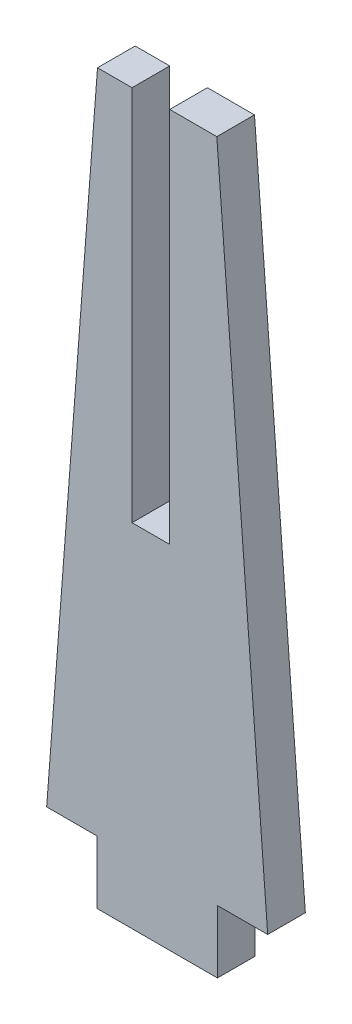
from build123d import *

# Parameters (mm, degrees)
SKETCH1_W           = 9.6
SKETCH1_H           = 5
BOSS_EXTRUDE1_DEPTH = 3


with BuildPart() as part:
    # Sketch1 → Boss-Extrude1 (new body)
    with BuildSketch(Plane.XY):
        Polygon((1, 25.5), (1, 55.5), (4.75, 55.5), (8.8, 2.5), (4.8, 2.5), (-4.8, 2.5), (-8.8, 2.5), (-4.75, 55.5), (-2, 55.5), (-2, 25.5), align=None)
        Rectangle(SKETCH1_W, SKETCH1_H)
    extrude(amount=BOSS_EXTRUDE1_DEPTH)


solid = part.part
